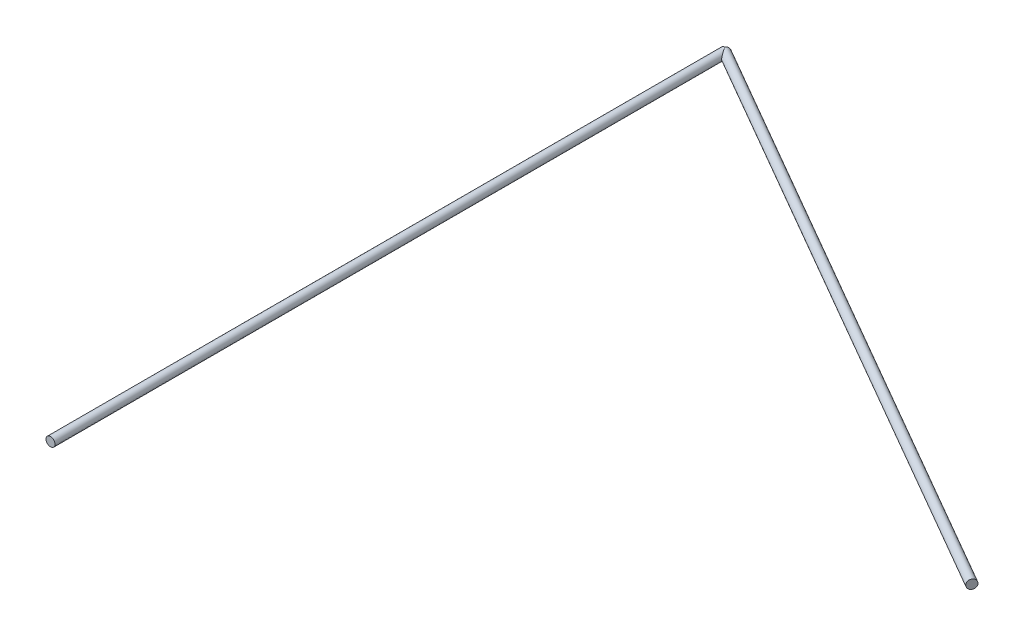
from build123d import *

# Parameters (mm, degrees)
ESQUISSE1_R                  = 2
EXTRUSION1_DEPTH             = 300
R_P_TITION_CIRCULAIRE1_COUNT = 2
R_P_TITION_CIRCULAIRE1_ANGLE = 60


with BuildPart() as part:
    # Esquisse1 → Extrusion1 (new body)
    with BuildSketch(Plane.XY):
        Circle(ESQUISSE1_R)
    extrusion1 = extrude(amount=EXTRUSION1_DEPTH)

    # R_p_tition circulaire1: Extrusion1 ×2 about axis
    r_p_tition_circulaire1_axis = Axis((0, 2.464135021, 0), (0, 1, 0))
    for i in range(1, R_P_TITION_CIRCULAIRE1_COUNT):
        add(extrusion1.rotate(r_p_tition_circulaire1_axis, i * R_P_TITION_CIRCULAIRE1_ANGLE / (R_P_TITION_CIRCULAIRE1_COUNT - 1)))


solid = part.part
